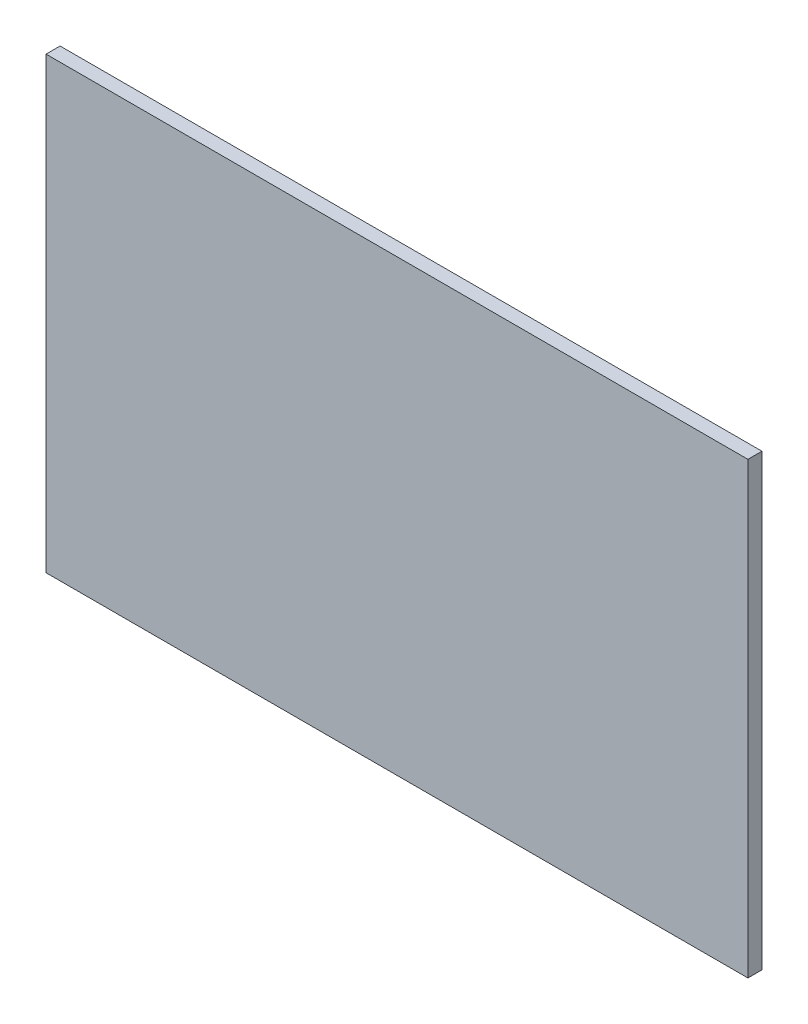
from build123d import *

# Parameters (mm, degrees)
SKETCH2_W           = 317.5
SKETCH2_H           = 203.2
BOSS_EXTRUDE1_DEPTH = 6.35


with BuildPart() as part:
    # Sketch2 → Boss-Extrude1 (new body)
    with BuildSketch(Plane.XY):
        with Locations((158.75, 101.6)):
            Rectangle(SKETCH2_W, SKETCH2_H)
    extrude(amount=BOSS_EXTRUDE1_DEPTH)


solid = part.part
